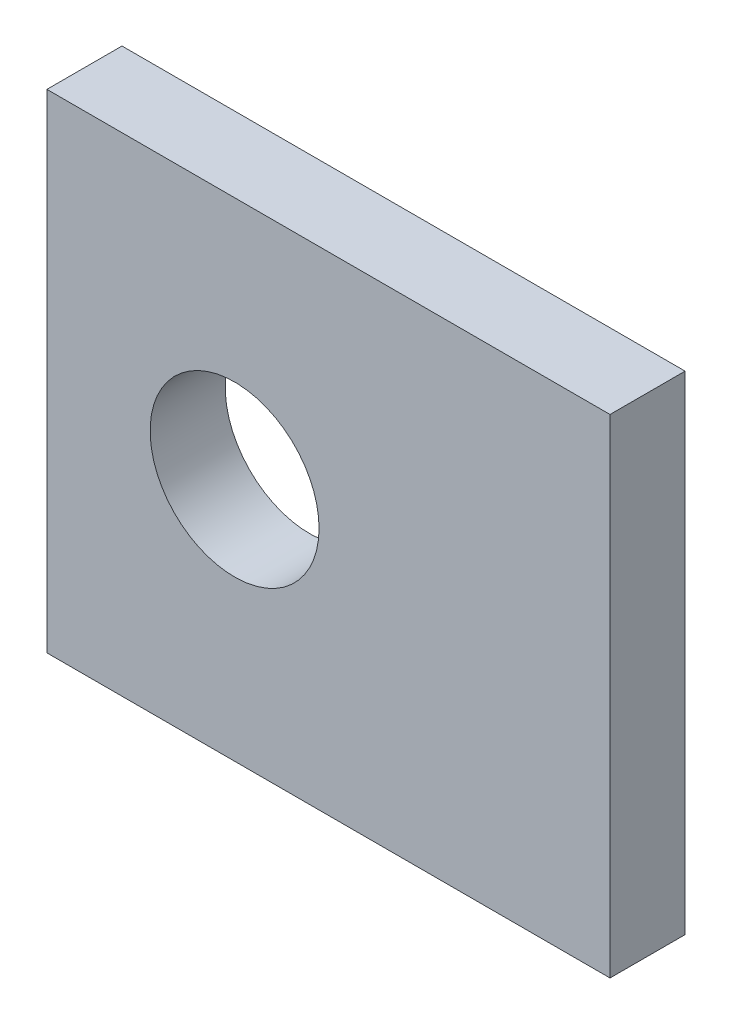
from build123d import *

# Parameters (mm, degrees)
SKETCH_1_W      = 15
SKETCH_1_H      = 13
SKETCH_1_R      = 2.25
EXTRUDE_1_DEPTH = 2


with BuildPart() as part:
    # Sketch 1 → Extrude 1 (new body)
    with BuildSketch(Plane.XY):
        with Locations((7.5, -6.5)):
            Rectangle(SKETCH_1_W, SKETCH_1_H)
        with Locations((5, -6.5)):
            Circle(SKETCH_1_R, mode=Mode.SUBTRACT)
    extrude(amount=EXTRUDE_1_DEPTH)


solid = part.part
